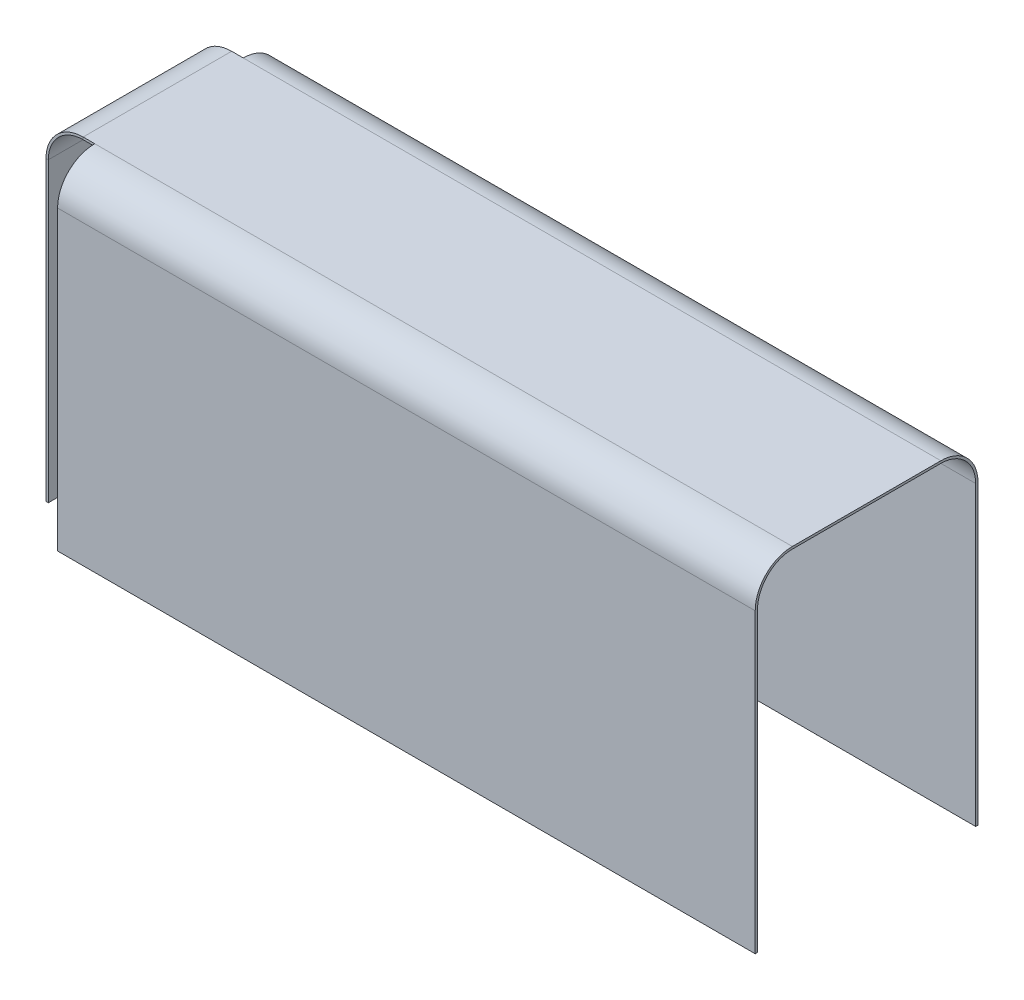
ISO-10303-21;
HEADER;
FILE_DESCRIPTION(('STEP AP214'),'2;1');
FILE_NAME('part.step','',(''),(''),'','','');
FILE_SCHEMA(('AUTOMOTIVE_DESIGN { 1 0 10303 214 1 1 1 1 }'));
ENDSEC;
DATA;
#1=APPLICATION_CONTEXT('core data for automotive mechanical design processes');
#2=APPLICATION_PROTOCOL_DEFINITION('international standard','automotive_design',2000,#1);
#3=PRODUCT_CONTEXT('',#1,'mechanical');
#4=PRODUCT('Part','Part','',(#3));
#5=PRODUCT_RELATED_PRODUCT_CATEGORY('part','',(#4));
#6=PRODUCT_DEFINITION_FORMATION('','',#4);
#7=PRODUCT_DEFINITION_CONTEXT('part definition',#1,'design');
#8=PRODUCT_DEFINITION('design','',#6,#7);
#9=PRODUCT_DEFINITION_SHAPE('','',#8);
#10=(LENGTH_UNIT() NAMED_UNIT(*) SI_UNIT(.MILLI.,.METRE.));
#11=(NAMED_UNIT(*) PLANE_ANGLE_UNIT() SI_UNIT($,.RADIAN.));
#12=(NAMED_UNIT(*) SI_UNIT($,.STERADIAN.) SOLID_ANGLE_UNIT());
#13=UNCERTAINTY_MEASURE_WITH_UNIT(LENGTH_MEASURE(1.E-05),#10,'distance_accuracy_value','');
#14=(GEOMETRIC_REPRESENTATION_CONTEXT(3) GLOBAL_UNCERTAINTY_ASSIGNED_CONTEXT((#13)) GLOBAL_UNIT_ASSIGNED_CONTEXT((#10,
#11,#12)) REPRESENTATION_CONTEXT('',''));
#15=CARTESIAN_POINT('',(0.,0.,0.));
#16=DIRECTION('',(0.,0.,1.));
#17=DIRECTION('',(1.,0.,0.));
#18=AXIS2_PLACEMENT_3D('',#15,#16,#17);
#19=CARTESIAN_POINT('',(-119.294275,114.3,38.1));
#20=DIRECTION('',(1.,0.,0.));
#21=DIRECTION('',(0.,0.,-1.));
#22=AXIS2_PLACEMENT_3D('',#19,#20,#21);
#23=PLANE('',#22);
#24=DIRECTION('',(0.,-1.,0.));
#25=VECTOR('',#24,1.);
#26=CARTESIAN_POINT('',(-119.294275,114.3,-25.4));
#27=LINE('',#26,#25);
#28=CARTESIAN_POINT('',(-119.294275,114.3,-25.4));
#29=VERTEX_POINT('',#28);
#30=CARTESIAN_POINT('',(-119.294275,113.50625,-25.4));
#31=VERTEX_POINT('',#30);
#32=EDGE_CURVE('E198',#29,#31,#27,.T.);
#33=ORIENTED_EDGE('',*,*,#32,.F.);
#34=CARTESIAN_POINT('',(-119.294275,101.6,-25.4));
#35=DIRECTION('',(1.,0.,0.));
#36=DIRECTION('',(0.,0.,-1.));
#37=AXIS2_PLACEMENT_3D('',#34,#35,#36);
#38=CIRCLE('',#37,12.7);
#39=CARTESIAN_POINT('',(-119.294275,101.6,-38.1));
#40=VERTEX_POINT('',#39);
#41=EDGE_CURVE('E315',#29,#40,#38,.F.);
#42=ORIENTED_EDGE('',*,*,#41,.T.);
#43=DIRECTION('',(0.,-1.,0.));
#44=VECTOR('',#43,1.);
#45=CARTESIAN_POINT('',(-119.294275,114.3,-38.1));
#46=LINE('',#45,#44);
#47=CARTESIAN_POINT('',(-119.294275,0.,-38.1));
#48=VERTEX_POINT('',#47);
#49=EDGE_CURVE('E285',#40,#48,#46,.T.);
#50=ORIENTED_EDGE('',*,*,#49,.T.);
#51=DIRECTION('',(0.,0.,1.));
#52=VECTOR('',#51,1.);
#53=CARTESIAN_POINT('',(-119.294275,0.,38.1));
#54=LINE('',#53,#52);
#55=CARTESIAN_POINT('',(-119.294275,0.,-37.30625));
#56=VERTEX_POINT('',#55);
#57=EDGE_CURVE('E287',#48,#56,#54,.T.);
#58=ORIENTED_EDGE('',*,*,#57,.T.);
#59=DIRECTION('',(0.,-1.,0.));
#60=VECTOR('',#59,1.);
#61=CARTESIAN_POINT('',(-119.294275,114.3,-37.30625));
#62=LINE('',#61,#60);
#63=CARTESIAN_POINT('',(-119.294275,101.6,-37.30625));
#64=VERTEX_POINT('',#63);
#65=EDGE_CURVE('E272',#64,#56,#62,.T.);
#66=ORIENTED_EDGE('',*,*,#65,.F.);
#67=CARTESIAN_POINT('',(-119.294275,101.6,-25.4));
#68=DIRECTION('',(1.,0.,0.));
#69=DIRECTION('',(0.,0.,-1.));
#70=AXIS2_PLACEMENT_3D('',#67,#68,#69);
#71=CIRCLE('',#70,11.90625);
#72=EDGE_CURVE('E262',#31,#64,#71,.F.);
#73=ORIENTED_EDGE('',*,*,#72,.F.);
#74=EDGE_LOOP('',(#33,#42,#50,#58,#66,#73));
#75=FACE_BOUND('',#74,.T.);
#76=ADVANCED_FACE('F33',(#75),#23,.F.);
#77=DIRECTION('',(0.,1.,0.));
#78=VECTOR('',#77,1.);
#79=CARTESIAN_POINT('',(-119.294275,114.3,25.4));
#80=LINE('',#79,#78);
#81=CARTESIAN_POINT('',(-119.294275,113.50625,25.4));
#82=VERTEX_POINT('',#81);
#83=CARTESIAN_POINT('',(-119.294275,114.3,25.4));
#84=VERTEX_POINT('',#83);
#85=EDGE_CURVE('E195',#82,#84,#80,.T.);
#86=ORIENTED_EDGE('',*,*,#85,.F.);
#87=CARTESIAN_POINT('',(-119.294275,101.6,25.4));
#88=DIRECTION('',(1.,0.,0.));
#89=DIRECTION('',(0.,0.,-1.));
#90=AXIS2_PLACEMENT_3D('',#87,#88,#89);
#91=CIRCLE('',#90,11.90625);
#92=CARTESIAN_POINT('',(-119.294275,101.6,37.30625));
#93=VERTEX_POINT('',#92);
#94=EDGE_CURVE('E258',#93,#82,#91,.F.);
#95=ORIENTED_EDGE('',*,*,#94,.F.);
#96=DIRECTION('',(0.,-1.,0.));
#97=VECTOR('',#96,1.);
#98=CARTESIAN_POINT('',(-119.294275,114.3,37.30625));
#99=LINE('',#98,#97);
#100=CARTESIAN_POINT('',(-119.294275,0.,37.30625));
#101=VERTEX_POINT('',#100);
#102=EDGE_CURVE('E256',#93,#101,#99,.T.);
#103=ORIENTED_EDGE('',*,*,#102,.T.);
#104=CARTESIAN_POINT('',(-119.294275,0.,38.1));
#105=VERTEX_POINT('',#104);
#106=EDGE_CURVE('E251',#101,#105,#54,.T.);
#107=ORIENTED_EDGE('',*,*,#106,.T.);
#108=DIRECTION('',(0.,-1.,0.));
#109=VECTOR('',#108,1.);
#110=CARTESIAN_POINT('',(-119.294275,114.3,38.1));
#111=LINE('',#110,#109);
#112=CARTESIAN_POINT('',(-119.294275,101.6,38.1));
#113=VERTEX_POINT('',#112);
#114=EDGE_CURVE('E305',#113,#105,#111,.T.);
#115=ORIENTED_EDGE('',*,*,#114,.F.);
#116=CARTESIAN_POINT('',(-119.294275,101.6,25.4));
#117=DIRECTION('',(1.,0.,0.));
#118=DIRECTION('',(0.,0.,-1.));
#119=AXIS2_PLACEMENT_3D('',#116,#117,#118);
#120=CIRCLE('',#119,12.7);
#121=EDGE_CURVE('E312',#113,#84,#120,.F.);
#122=ORIENTED_EDGE('',*,*,#121,.T.);
#123=EDGE_LOOP('',(#86,#95,#103,#107,#115,#122));
#124=FACE_BOUND('',#123,.T.);
#125=ADVANCED_FACE('F358',(#124),#23,.F.);
#126=CARTESIAN_POINT('',(0.,0.,0.));
#127=DIRECTION('',(0.,-1.,0.));
#128=DIRECTION('',(0.,0.,-1.));
#129=AXIS2_PLACEMENT_3D('',#126,#127,#128);
#130=PLANE('',#129);
#131=DIRECTION('',(0.,0.,-1.));
#132=VECTOR('',#131,1.);
#133=CARTESIAN_POINT('',(119.294275,0.,38.1));
#134=LINE('',#133,#132);
#135=CARTESIAN_POINT('',(119.294275,0.,-37.30625));
#136=VERTEX_POINT('',#135);
#137=CARTESIAN_POINT('',(119.294275,0.,-38.1));
#138=VERTEX_POINT('',#137);
#139=EDGE_CURVE('E293',#136,#138,#134,.T.);
#140=ORIENTED_EDGE('',*,*,#139,.F.);
#141=DIRECTION('',(-1.,0.,0.));
#142=VECTOR('',#141,1.);
#143=CARTESIAN_POINT('',(0.,0.,-37.30625));
#144=LINE('',#143,#142);
#145=EDGE_CURVE('E266',#136,#56,#144,.T.);
#146=ORIENTED_EDGE('',*,*,#145,.T.);
#147=ORIENTED_EDGE('',*,*,#57,.F.);
#148=DIRECTION('',(-1.,0.,0.));
#149=VECTOR('',#148,1.);
#150=CARTESIAN_POINT('',(-119.294275,0.,-38.1));
#151=LINE('',#150,#149);
#152=EDGE_CURVE('E286',#138,#48,#151,.T.);
#153=ORIENTED_EDGE('',*,*,#152,.F.);
#154=EDGE_LOOP('',(#140,#146,#147,#153));
#155=FACE_BOUND('',#154,.T.);
#156=ADVANCED_FACE('F336',(#155),#130,.T.);
#157=ORIENTED_EDGE('',*,*,#106,.F.);
#158=DIRECTION('',(1.,0.,0.));
#159=VECTOR('',#158,1.);
#160=CARTESIAN_POINT('',(0.,0.,37.30625));
#161=LINE('',#160,#159);
#162=CARTESIAN_POINT('',(119.294275,0.,37.30625));
#163=VERTEX_POINT('',#162);
#164=EDGE_CURVE('E248',#101,#163,#161,.T.);
#165=ORIENTED_EDGE('',*,*,#164,.T.);
#166=CARTESIAN_POINT('',(119.294275,0.,38.1));
#167=VERTEX_POINT('',#166);
#168=EDGE_CURVE('E294',#167,#163,#134,.T.);
#169=ORIENTED_EDGE('',*,*,#168,.F.);
#170=DIRECTION('',(1.,0.,0.));
#171=VECTOR('',#170,1.);
#172=CARTESIAN_POINT('',(-119.294275,0.,38.1));
#173=LINE('',#172,#171);
#174=EDGE_CURVE('E290',#105,#167,#173,.T.);
#175=ORIENTED_EDGE('',*,*,#174,.F.);
#176=EDGE_LOOP('',(#157,#165,#169,#175));
#177=FACE_BOUND('',#176,.T.);
#178=ADVANCED_FACE('F419',(#177),#130,.T.);
#179=CARTESIAN_POINT('',(-119.294275,114.3,38.1));
#180=DIRECTION('',(0.,0.,-1.));
#181=DIRECTION('',(-1.,0.,0.));
#182=AXIS2_PLACEMENT_3D('',#179,#180,#181);
#183=PLANE('',#182);
#184=DIRECTION('',(0.,-1.,0.));
#185=VECTOR('',#184,1.);
#186=CARTESIAN_POINT('',(119.294275,114.3,38.1));
#187=LINE('',#186,#185);
#188=CARTESIAN_POINT('',(119.294275,101.6,38.1));
#189=VERTEX_POINT('',#188);
#190=EDGE_CURVE('E303',#189,#167,#187,.T.);
#191=ORIENTED_EDGE('',*,*,#190,.F.);
#192=DIRECTION('',(1.,0.,0.));
#193=VECTOR('',#192,1.);
#194=CARTESIAN_POINT('',(-119.294275,101.6,38.1));
#195=LINE('',#194,#193);
#196=EDGE_CURVE('E11',#189,#113,#195,.F.);
#197=ORIENTED_EDGE('',*,*,#196,.T.);
#198=ORIENTED_EDGE('',*,*,#114,.T.);
#199=ORIENTED_EDGE('',*,*,#174,.T.);
#200=EDGE_LOOP('',(#191,#197,#198,#199));
#201=FACE_BOUND('',#200,.T.);
#202=ADVANCED_FACE('F403',(#201),#183,.F.);
#203=CARTESIAN_POINT('',(119.294275,114.3,38.1));
#204=DIRECTION('',(-1.,0.,0.));
#205=DIRECTION('',(0.,0.,1.));
#206=AXIS2_PLACEMENT_3D('',#203,#204,#205);
#207=PLANE('',#206);
#208=CARTESIAN_POINT('',(119.294275,101.6,-25.4));
#209=DIRECTION('',(-1.,0.,0.));
#210=DIRECTION('',(0.,0.,1.));
#211=AXIS2_PLACEMENT_3D('',#208,#209,#210);
#212=CIRCLE('',#211,11.90625);
#213=CARTESIAN_POINT('',(119.294275,101.6,-37.30625));
#214=VERTEX_POINT('',#213);
#215=CARTESIAN_POINT('',(119.294275,113.50625,-25.4));
#216=VERTEX_POINT('',#215);
#217=EDGE_CURVE('E252',#214,#216,#212,.F.);
#218=ORIENTED_EDGE('',*,*,#217,.F.);
#219=DIRECTION('',(0.,-1.,0.));
#220=VECTOR('',#219,1.);
#221=CARTESIAN_POINT('',(119.294275,114.3,-37.30625));
#222=LINE('',#221,#220);
#223=EDGE_CURVE('E264',#214,#136,#222,.T.);
#224=ORIENTED_EDGE('',*,*,#223,.T.);
#225=ORIENTED_EDGE('',*,*,#139,.T.);
#226=DIRECTION('',(0.,-1.,0.));
#227=VECTOR('',#226,1.);
#228=CARTESIAN_POINT('',(119.294275,114.3,-38.1));
#229=LINE('',#228,#227);
#230=CARTESIAN_POINT('',(119.294275,101.6,-38.1));
#231=VERTEX_POINT('',#230);
#232=EDGE_CURVE('E300',#231,#138,#229,.T.);
#233=ORIENTED_EDGE('',*,*,#232,.F.);
#234=CARTESIAN_POINT('',(119.294275,101.6,-25.4));
#235=DIRECTION('',(-1.,0.,0.));
#236=DIRECTION('',(0.,0.,1.));
#237=AXIS2_PLACEMENT_3D('',#234,#235,#236);
#238=CIRCLE('',#237,12.7);
#239=CARTESIAN_POINT('',(119.294275,114.3,-25.4));
#240=VERTEX_POINT('',#239);
#241=EDGE_CURVE('E41',#231,#240,#238,.F.);
#242=ORIENTED_EDGE('',*,*,#241,.T.);
#243=DIRECTION('',(0.,0.,-1.));
#244=VECTOR('',#243,1.);
#245=CARTESIAN_POINT('',(119.294275,114.3,38.1));
#246=LINE('',#245,#244);
#247=CARTESIAN_POINT('',(119.294275,114.3,25.4));
#248=VERTEX_POINT('',#247);
#249=EDGE_CURVE('E283',#248,#240,#246,.T.);
#250=ORIENTED_EDGE('',*,*,#249,.F.);
#251=CARTESIAN_POINT('',(119.294275,101.6,25.4));
#252=DIRECTION('',(-1.,0.,0.));
#253=DIRECTION('',(0.,0.,1.));
#254=AXIS2_PLACEMENT_3D('',#251,#252,#253);
#255=CIRCLE('',#254,12.7);
#256=EDGE_CURVE('E56',#248,#189,#255,.F.);
#257=ORIENTED_EDGE('',*,*,#256,.T.);
#258=ORIENTED_EDGE('',*,*,#190,.T.);
#259=ORIENTED_EDGE('',*,*,#168,.T.);
#260=DIRECTION('',(0.,-1.,0.));
#261=VECTOR('',#260,1.);
#262=CARTESIAN_POINT('',(119.294275,114.3,37.30625));
#263=LINE('',#262,#261);
#264=CARTESIAN_POINT('',(119.294275,101.6,37.30625));
#265=VERTEX_POINT('',#264);
#266=EDGE_CURVE('E48',#265,#163,#263,.T.);
#267=ORIENTED_EDGE('',*,*,#266,.F.);
#268=CARTESIAN_POINT('',(119.294275,101.6,25.4));
#269=DIRECTION('',(-1.,0.,0.));
#270=DIRECTION('',(0.,0.,1.));
#271=AXIS2_PLACEMENT_3D('',#268,#269,#270);
#272=CIRCLE('',#271,11.90625);
#273=CARTESIAN_POINT('',(119.294275,113.50625,25.4));
#274=VERTEX_POINT('',#273);
#275=EDGE_CURVE('E261',#274,#265,#272,.F.);
#276=ORIENTED_EDGE('',*,*,#275,.F.);
#277=DIRECTION('',(0.,0.,-1.));
#278=VECTOR('',#277,1.);
#279=CARTESIAN_POINT('',(119.294275,113.50625,0.));
#280=LINE('',#279,#278);
#281=EDGE_CURVE('E274',#274,#216,#280,.T.);
#282=ORIENTED_EDGE('',*,*,#281,.T.);
#283=EDGE_LOOP('',(#218,#224,#225,#233,#242,#250,#257,#258,#259,#267,#276,#282));
#284=FACE_BOUND('',#283,.T.);
#285=ADVANCED_FACE('F322',(#284),#207,.F.);
#286=CARTESIAN_POINT('',(-119.294275,114.3,-38.1));
#287=DIRECTION('',(0.,0.,1.));
#288=DIRECTION('',(1.,0.,0.));
#289=AXIS2_PLACEMENT_3D('',#286,#287,#288);
#290=PLANE('',#289);
#291=ORIENTED_EDGE('',*,*,#49,.F.);
#292=DIRECTION('',(-1.,0.,0.));
#293=VECTOR('',#292,1.);
#294=CARTESIAN_POINT('',(-119.294275,101.6,-38.1));
#295=LINE('',#294,#293);
#296=EDGE_CURVE('E317',#40,#231,#295,.F.);
#297=ORIENTED_EDGE('',*,*,#296,.T.);
#298=ORIENTED_EDGE('',*,*,#232,.T.);
#299=ORIENTED_EDGE('',*,*,#152,.T.);
#300=EDGE_LOOP('',(#291,#297,#298,#299));
#301=FACE_BOUND('',#300,.T.);
#302=ADVANCED_FACE('F331',(#301),#290,.F.);
#303=CARTESIAN_POINT('',(0.,114.3,0.));
#304=DIRECTION('',(0.,-1.,0.));
#305=DIRECTION('',(0.,0.,-1.));
#306=AXIS2_PLACEMENT_3D('',#303,#304,#305);
#307=PLANE('',#306);
#308=ORIENTED_EDGE('',*,*,#249,.T.);
#309=DIRECTION('',(-1.,0.,0.));
#310=VECTOR('',#309,1.);
#311=CARTESIAN_POINT('',(0.,114.3,-25.4));
#312=LINE('',#311,#310);
#313=EDGE_CURVE('E194',#240,#29,#312,.T.);
#314=ORIENTED_EDGE('',*,*,#313,.T.);
#315=DIRECTION('',(-1.,0.,0.));
#316=VECTOR('',#315,1.);
#317=CARTESIAN_POINT('',(-119.294275,114.3,-25.4));
#318=LINE('',#317,#316);
#319=CARTESIAN_POINT('',(-123.263025,114.3,-25.4));
#320=VERTEX_POINT('',#319);
#321=EDGE_CURVE('E186',#29,#320,#318,.T.);
#322=ORIENTED_EDGE('',*,*,#321,.T.);
#323=DIRECTION('',(0.,0.,-1.));
#324=VECTOR('',#323,1.);
#325=CARTESIAN_POINT('',(-123.263025,114.3,-25.4));
#326=LINE('',#325,#324);
#327=CARTESIAN_POINT('',(-123.263025,114.3,25.4));
#328=VERTEX_POINT('',#327);
#329=EDGE_CURVE('E169',#328,#320,#326,.T.);
#330=ORIENTED_EDGE('',*,*,#329,.F.);
#331=DIRECTION('',(-1.,0.,0.));
#332=VECTOR('',#331,1.);
#333=CARTESIAN_POINT('',(-119.294275,114.3,25.4));
#334=LINE('',#333,#332);
#335=EDGE_CURVE('E179',#84,#328,#334,.T.);
#336=ORIENTED_EDGE('',*,*,#335,.F.);
#337=DIRECTION('',(1.,0.,0.));
#338=VECTOR('',#337,1.);
#339=CARTESIAN_POINT('',(0.,114.3,25.4));
#340=LINE('',#339,#338);
#341=EDGE_CURVE('E308',#84,#248,#340,.T.);
#342=ORIENTED_EDGE('',*,*,#341,.T.);
#343=EDGE_LOOP('',(#308,#314,#322,#330,#336,#342));
#344=FACE_BOUND('',#343,.T.);
#345=ADVANCED_FACE('F192',(#344),#307,.F.);
#346=CARTESIAN_POINT('',(0.,101.6,-25.4));
#347=DIRECTION('',(-1.,0.,0.));
#348=DIRECTION('',(0.,0.,1.));
#349=AXIS2_PLACEMENT_3D('',#346,#347,#348);
#350=CYLINDRICAL_SURFACE('',#349,12.7);
#351=ORIENTED_EDGE('',*,*,#241,.F.);
#352=ORIENTED_EDGE('',*,*,#296,.F.);
#353=ORIENTED_EDGE('',*,*,#41,.F.);
#354=ORIENTED_EDGE('',*,*,#313,.F.);
#355=EDGE_LOOP('',(#351,#352,#353,#354));
#356=FACE_BOUND('',#355,.T.);
#357=ADVANCED_FACE('F326',(#356),#350,.T.);
#358=CARTESIAN_POINT('',(0.,101.6,25.4));
#359=DIRECTION('',(1.,0.,0.));
#360=DIRECTION('',(0.,0.,-1.));
#361=AXIS2_PLACEMENT_3D('',#358,#359,#360);
#362=CYLINDRICAL_SURFACE('',#361,12.7);
#363=ORIENTED_EDGE('',*,*,#121,.F.);
#364=ORIENTED_EDGE('',*,*,#196,.F.);
#365=ORIENTED_EDGE('',*,*,#256,.F.);
#366=ORIENTED_EDGE('',*,*,#341,.F.);
#367=EDGE_LOOP('',(#363,#364,#365,#366));
#368=FACE_BOUND('',#367,.T.);
#369=ADVANCED_FACE('F35',(#368),#362,.T.);
#370=CARTESIAN_POINT('',(-119.294275,114.3,37.30625));
#371=DIRECTION('',(0.,0.,-1.));
#372=DIRECTION('',(-1.,0.,0.));
#373=AXIS2_PLACEMENT_3D('',#370,#371,#372);
#374=PLANE('',#373);
#375=ORIENTED_EDGE('',*,*,#266,.T.);
#376=ORIENTED_EDGE('',*,*,#164,.F.);
#377=ORIENTED_EDGE('',*,*,#102,.F.);
#378=DIRECTION('',(-1.,0.,0.));
#379=VECTOR('',#378,1.);
#380=CARTESIAN_POINT('',(-119.294275,101.6,37.30625));
#381=LINE('',#380,#379);
#382=EDGE_CURVE('E249',#265,#93,#381,.T.);
#383=ORIENTED_EDGE('',*,*,#382,.F.);
#384=EDGE_LOOP('',(#375,#376,#377,#383));
#385=FACE_BOUND('',#384,.T.);
#386=ADVANCED_FACE('F354',(#385),#374,.T.);
#387=CARTESIAN_POINT('',(-119.294275,114.3,-37.30625));
#388=DIRECTION('',(0.,0.,1.));
#389=DIRECTION('',(1.,0.,0.));
#390=AXIS2_PLACEMENT_3D('',#387,#388,#389);
#391=PLANE('',#390);
#392=ORIENTED_EDGE('',*,*,#65,.T.);
#393=ORIENTED_EDGE('',*,*,#145,.F.);
#394=ORIENTED_EDGE('',*,*,#223,.F.);
#395=DIRECTION('',(1.,0.,0.));
#396=VECTOR('',#395,1.);
#397=CARTESIAN_POINT('',(-119.294275,101.6,-37.30625));
#398=LINE('',#397,#396);
#399=EDGE_CURVE('E259',#64,#214,#398,.T.);
#400=ORIENTED_EDGE('',*,*,#399,.F.);
#401=EDGE_LOOP('',(#392,#393,#394,#400));
#402=FACE_BOUND('',#401,.T.);
#403=ADVANCED_FACE('F340',(#402),#391,.T.);
#404=CARTESIAN_POINT('',(0.,113.50625,0.));
#405=DIRECTION('',(0.,-1.,0.));
#406=DIRECTION('',(0.,0.,-1.));
#407=AXIS2_PLACEMENT_3D('',#404,#405,#406);
#408=PLANE('',#407);
#409=ORIENTED_EDGE('',*,*,#281,.F.);
#410=DIRECTION('',(1.,0.,0.));
#411=VECTOR('',#410,1.);
#412=CARTESIAN_POINT('',(0.,113.50625,25.4));
#413=LINE('',#412,#411);
#414=EDGE_CURVE('E253',#82,#274,#413,.T.);
#415=ORIENTED_EDGE('',*,*,#414,.F.);
#416=DIRECTION('',(-1.,0.,0.));
#417=VECTOR('',#416,1.);
#418=CARTESIAN_POINT('',(-119.294275,113.50625,25.4));
#419=LINE('',#418,#417);
#420=CARTESIAN_POINT('',(-123.263025,113.50625,25.4));
#421=VERTEX_POINT('',#420);
#422=EDGE_CURVE('E219',#82,#421,#419,.T.);
#423=ORIENTED_EDGE('',*,*,#422,.T.);
#424=DIRECTION('',(0.,0.,1.));
#425=VECTOR('',#424,1.);
#426=CARTESIAN_POINT('',(-123.263025,113.50625,-25.4));
#427=LINE('',#426,#425);
#428=CARTESIAN_POINT('',(-123.263025,113.50625,-25.4));
#429=VERTEX_POINT('',#428);
#430=EDGE_CURVE('E216',#429,#421,#427,.T.);
#431=ORIENTED_EDGE('',*,*,#430,.F.);
#432=DIRECTION('',(-1.,0.,0.));
#433=VECTOR('',#432,1.);
#434=CARTESIAN_POINT('',(-119.294275,113.50625,-25.4));
#435=LINE('',#434,#433);
#436=EDGE_CURVE('E188',#31,#429,#435,.T.);
#437=ORIENTED_EDGE('',*,*,#436,.F.);
#438=DIRECTION('',(1.,0.,0.));
#439=VECTOR('',#438,1.);
#440=CARTESIAN_POINT('',(0.,113.50625,-25.4));
#441=LINE('',#440,#439);
#442=EDGE_CURVE('E255',#216,#31,#441,.F.);
#443=ORIENTED_EDGE('',*,*,#442,.F.);
#444=EDGE_LOOP('',(#409,#415,#423,#431,#437,#443));
#445=FACE_BOUND('',#444,.T.);
#446=ADVANCED_FACE('F347',(#445),#408,.T.);
#447=CARTESIAN_POINT('',(0.,101.6,-25.4));
#448=DIRECTION('',(-1.,0.,0.));
#449=DIRECTION('',(0.,0.,1.));
#450=AXIS2_PLACEMENT_3D('',#447,#448,#449);
#451=CYLINDRICAL_SURFACE('',#450,11.90625);
#452=ORIENTED_EDGE('',*,*,#217,.T.);
#453=ORIENTED_EDGE('',*,*,#442,.T.);
#454=ORIENTED_EDGE('',*,*,#72,.T.);
#455=ORIENTED_EDGE('',*,*,#399,.T.);
#456=EDGE_LOOP('',(#452,#453,#454,#455));
#457=FACE_BOUND('',#456,.T.);
#458=ADVANCED_FACE('F343',(#457),#451,.F.);
#459=CARTESIAN_POINT('',(0.,101.6,25.4));
#460=DIRECTION('',(1.,0.,0.));
#461=DIRECTION('',(0.,0.,-1.));
#462=AXIS2_PLACEMENT_3D('',#459,#460,#461);
#463=CYLINDRICAL_SURFACE('',#462,11.90625);
#464=ORIENTED_EDGE('',*,*,#94,.T.);
#465=ORIENTED_EDGE('',*,*,#414,.T.);
#466=ORIENTED_EDGE('',*,*,#275,.T.);
#467=ORIENTED_EDGE('',*,*,#382,.T.);
#468=EDGE_LOOP('',(#464,#465,#466,#467));
#469=FACE_BOUND('',#468,.T.);
#470=ADVANCED_FACE('F352',(#469),#463,.F.);
#471=CARTESIAN_POINT('',(-21.663025,0.,0.));
#472=DIRECTION('',(0.,-1.,0.));
#473=DIRECTION('',(0.,0.,1.));
#474=AXIS2_PLACEMENT_3D('',#471,#472,#473);
#475=PLANE('',#474);
#476=DIRECTION('',(1.,0.,0.));
#477=VECTOR('',#476,1.);
#478=CARTESIAN_POINT('',(-135.963025,0.,-25.4));
#479=LINE('',#478,#477);
#480=CARTESIAN_POINT('',(-135.963025,0.,-25.4));
#481=VERTEX_POINT('',#480);
#482=CARTESIAN_POINT('',(-135.169275,0.,-25.4));
#483=VERTEX_POINT('',#482);
#484=EDGE_CURVE('E206',#481,#483,#479,.T.);
#485=ORIENTED_EDGE('',*,*,#484,.T.);
#486=DIRECTION('',(0.,0.,1.));
#487=VECTOR('',#486,1.);
#488=CARTESIAN_POINT('',(-135.169275,0.,-25.4));
#489=LINE('',#488,#487);
#490=CARTESIAN_POINT('',(-135.169275,0.,25.4));
#491=VERTEX_POINT('',#490);
#492=EDGE_CURVE('E212',#483,#491,#489,.T.);
#493=ORIENTED_EDGE('',*,*,#492,.T.);
#494=DIRECTION('',(-1.,0.,0.));
#495=VECTOR('',#494,1.);
#496=CARTESIAN_POINT('',(-135.963025,0.,25.4));
#497=LINE('',#496,#495);
#498=CARTESIAN_POINT('',(-135.963025,0.,25.4));
#499=VERTEX_POINT('',#498);
#500=EDGE_CURVE('E232',#491,#499,#497,.T.);
#501=ORIENTED_EDGE('',*,*,#500,.T.);
#502=DIRECTION('',(0.,0.,-1.));
#503=VECTOR('',#502,1.);
#504=CARTESIAN_POINT('',(-135.963025,0.,-25.4));
#505=LINE('',#504,#503);
#506=EDGE_CURVE('E243',#499,#481,#505,.T.);
#507=ORIENTED_EDGE('',*,*,#506,.T.);
#508=EDGE_LOOP('',(#485,#493,#501,#507));
#509=FACE_BOUND('',#508,.T.);
#510=ADVANCED_FACE('F382',(#509),#475,.T.);
#511=CARTESIAN_POINT('',(-119.294275,114.3,-25.4));
#512=DIRECTION('',(0.,0.,-1.));
#513=DIRECTION('',(-1.,0.,0.));
#514=AXIS2_PLACEMENT_3D('',#511,#512,#513);
#515=PLANE('',#514);
#516=ORIENTED_EDGE('',*,*,#436,.T.);
#517=DIRECTION('',(0.,-1.,0.));
#518=VECTOR('',#517,1.);
#519=CARTESIAN_POINT('',(-123.263025,114.3,-25.4));
#520=LINE('',#519,#518);
#521=EDGE_CURVE('E164',#320,#429,#520,.T.);
#522=ORIENTED_EDGE('',*,*,#521,.F.);
#523=ORIENTED_EDGE('',*,*,#321,.F.);
#524=ORIENTED_EDGE('',*,*,#32,.T.);
#525=EDGE_LOOP('',(#516,#522,#523,#524));
#526=FACE_BOUND('',#525,.T.);
#527=ADVANCED_FACE('F184',(#526),#515,.T.);
#528=CARTESIAN_POINT('',(-119.294275,114.3,25.4));
#529=DIRECTION('',(0.,0.,1.));
#530=DIRECTION('',(0.,-1.,0.));
#531=AXIS2_PLACEMENT_3D('',#528,#529,#530);
#532=PLANE('',#531);
#533=ORIENTED_EDGE('',*,*,#335,.T.);
#534=DIRECTION('',(0.,1.,0.));
#535=VECTOR('',#534,1.);
#536=CARTESIAN_POINT('',(-123.263025,114.3,25.4));
#537=LINE('',#536,#535);
#538=EDGE_CURVE('E222',#421,#328,#537,.T.);
#539=ORIENTED_EDGE('',*,*,#538,.F.);
#540=ORIENTED_EDGE('',*,*,#422,.F.);
#541=ORIENTED_EDGE('',*,*,#85,.T.);
#542=EDGE_LOOP('',(#533,#539,#540,#541));
#543=FACE_BOUND('',#542,.T.);
#544=ADVANCED_FACE('F362',(#543),#532,.T.);
#545=CARTESIAN_POINT('',(-123.263025,114.3,-25.4));
#546=DIRECTION('',(0.,0.,-1.));
#547=DIRECTION('',(-1.,0.,0.));
#548=AXIS2_PLACEMENT_3D('',#545,#546,#547);
#549=PLANE('',#548);
#550=CARTESIAN_POINT('',(-123.263025,101.6,-25.4));
#551=DIRECTION('',(0.,0.,1.));
#552=DIRECTION('',(0.,1.,0.));
#553=AXIS2_PLACEMENT_3D('',#550,#551,#552);
#554=CIRCLE('',#553,11.90625);
#555=CARTESIAN_POINT('',(-135.169275,101.6,-25.4));
#556=VERTEX_POINT('',#555);
#557=EDGE_CURVE('E203',#429,#556,#554,.T.);
#558=ORIENTED_EDGE('',*,*,#557,.T.);
#559=DIRECTION('',(1.,0.,0.));
#560=VECTOR('',#559,1.);
#561=CARTESIAN_POINT('',(-135.963025,101.6,-25.4));
#562=LINE('',#561,#560);
#563=CARTESIAN_POINT('',(-135.963025,101.6,-25.4));
#564=VERTEX_POINT('',#563);
#565=EDGE_CURVE('E166',#564,#556,#562,.T.);
#566=ORIENTED_EDGE('',*,*,#565,.F.);
#567=CARTESIAN_POINT('',(-123.263025,101.6,-25.4));
#568=DIRECTION('',(0.,0.,1.));
#569=DIRECTION('',(0.,1.,0.));
#570=AXIS2_PLACEMENT_3D('',#567,#568,#569);
#571=CIRCLE('',#570,12.7);
#572=EDGE_CURVE('E159',#320,#564,#571,.T.);
#573=ORIENTED_EDGE('',*,*,#572,.F.);
#574=ORIENTED_EDGE('',*,*,#521,.T.);
#575=EDGE_LOOP('',(#558,#566,#573,#574));
#576=FACE_BOUND('',#575,.T.);
#577=ADVANCED_FACE('F162',(#576),#549,.T.);
#578=CARTESIAN_POINT('',(-123.263025,101.6,0.));
#579=DIRECTION('',(0.,0.,1.));
#580=DIRECTION('',(1.,0.,0.));
#581=AXIS2_PLACEMENT_3D('',#578,#579,#580);
#582=CYLINDRICAL_SURFACE('',#581,11.90625);
#583=CARTESIAN_POINT('',(-123.263025,101.6,25.4));
#584=DIRECTION('',(0.,0.,1.));
#585=DIRECTION('',(0.,1.,0.));
#586=AXIS2_PLACEMENT_3D('',#583,#584,#585);
#587=CIRCLE('',#586,11.90625);
#588=CARTESIAN_POINT('',(-135.169275,101.6,25.4));
#589=VERTEX_POINT('',#588);
#590=EDGE_CURVE('E225',#421,#589,#587,.T.);
#591=ORIENTED_EDGE('',*,*,#590,.T.);
#592=DIRECTION('',(0.,0.,1.));
#593=VECTOR('',#592,1.);
#594=CARTESIAN_POINT('',(-135.169275,101.6,-25.4));
#595=LINE('',#594,#593);
#596=EDGE_CURVE('E204',#556,#589,#595,.T.);
#597=ORIENTED_EDGE('',*,*,#596,.F.);
#598=ORIENTED_EDGE('',*,*,#557,.F.);
#599=ORIENTED_EDGE('',*,*,#430,.T.);
#600=EDGE_LOOP('',(#591,#597,#598,#599));
#601=FACE_BOUND('',#600,.T.);
#602=ADVANCED_FACE('F368',(#601),#582,.F.);
#603=CARTESIAN_POINT('',(-123.263025,114.3,25.4));
#604=DIRECTION('',(0.,0.,1.));
#605=DIRECTION('',(1.,0.,0.));
#606=AXIS2_PLACEMENT_3D('',#603,#604,#605);
#607=PLANE('',#606);
#608=CARTESIAN_POINT('',(-123.263025,101.6,25.4));
#609=DIRECTION('',(0.,0.,1.));
#610=DIRECTION('',(0.,1.,0.));
#611=AXIS2_PLACEMENT_3D('',#608,#609,#610);
#612=CIRCLE('',#611,12.7);
#613=CARTESIAN_POINT('',(-135.963025,101.6,25.4));
#614=VERTEX_POINT('',#613);
#615=EDGE_CURVE('E174',#328,#614,#612,.T.);
#616=ORIENTED_EDGE('',*,*,#615,.T.);
#617=DIRECTION('',(-1.,0.,0.));
#618=VECTOR('',#617,1.);
#619=CARTESIAN_POINT('',(-135.963025,101.6,25.4));
#620=LINE('',#619,#618);
#621=EDGE_CURVE('E228',#589,#614,#620,.T.);
#622=ORIENTED_EDGE('',*,*,#621,.F.);
#623=ORIENTED_EDGE('',*,*,#590,.F.);
#624=ORIENTED_EDGE('',*,*,#538,.T.);
#625=EDGE_LOOP('',(#616,#622,#623,#624));
#626=FACE_BOUND('',#625,.T.);
#627=ADVANCED_FACE('F364',(#626),#607,.T.);
#628=CARTESIAN_POINT('',(-123.263025,101.6,0.));
#629=DIRECTION('',(0.,0.,1.));
#630=DIRECTION('',(1.,0.,0.));
#631=AXIS2_PLACEMENT_3D('',#628,#629,#630);
#632=CYLINDRICAL_SURFACE('',#631,12.7);
#633=DIRECTION('',(0.,0.,-1.));
#634=VECTOR('',#633,1.);
#635=CARTESIAN_POINT('',(-135.963025,101.6,-25.4));
#636=LINE('',#635,#634);
#637=EDGE_CURVE('E215',#614,#564,#636,.T.);
#638=ORIENTED_EDGE('',*,*,#637,.F.);
#639=ORIENTED_EDGE('',*,*,#615,.F.);
#640=ORIENTED_EDGE('',*,*,#329,.T.);
#641=ORIENTED_EDGE('',*,*,#572,.T.);
#642=EDGE_LOOP('',(#638,#639,#640,#641));
#643=FACE_BOUND('',#642,.T.);
#644=ADVANCED_FACE('F172',(#643),#632,.T.);
#645=CARTESIAN_POINT('',(-135.963025,101.6,-25.4));
#646=DIRECTION('',(0.,0.,-1.));
#647=DIRECTION('',(-1.,0.,0.));
#648=AXIS2_PLACEMENT_3D('',#645,#646,#647);
#649=PLANE('',#648);
#650=DIRECTION('',(0.,-1.,0.));
#651=VECTOR('',#650,1.);
#652=CARTESIAN_POINT('',(-135.169275,101.6,-25.4));
#653=LINE('',#652,#651);
#654=EDGE_CURVE('E208',#556,#483,#653,.T.);
#655=ORIENTED_EDGE('',*,*,#654,.T.);
#656=ORIENTED_EDGE('',*,*,#484,.F.);
#657=DIRECTION('',(0.,-1.,0.));
#658=VECTOR('',#657,1.);
#659=CARTESIAN_POINT('',(-135.963025,101.6,-25.4));
#660=LINE('',#659,#658);
#661=EDGE_CURVE('E209',#564,#481,#660,.T.);
#662=ORIENTED_EDGE('',*,*,#661,.F.);
#663=ORIENTED_EDGE('',*,*,#565,.T.);
#664=EDGE_LOOP('',(#655,#656,#662,#663));
#665=FACE_BOUND('',#664,.T.);
#666=ADVANCED_FACE('F374',(#665),#649,.T.);
#667=CARTESIAN_POINT('',(-135.169275,101.6,-25.4));
#668=DIRECTION('',(1.,0.,0.));
#669=DIRECTION('',(0.,0.,-1.));
#670=AXIS2_PLACEMENT_3D('',#667,#668,#669);
#671=PLANE('',#670);
#672=CARTESIAN_POINT('',(-135.169275,22.5425,0.));
#673=DIRECTION('',(1.,0.,0.));
#674=DIRECTION('',(0.,0.,-1.));
#675=AXIS2_PLACEMENT_3D('',#672,#673,#674);
#676=CIRCLE('',#675,2.54);
#677=CARTESIAN_POINT('',(-135.169275,22.5425,-2.54));
#678=VERTEX_POINT('',#677);
#679=EDGE_CURVE('E578',#678,#678,#676,.T.);
#680=ORIENTED_EDGE('',*,*,#679,.F.);
#681=EDGE_LOOP('',(#680));
#682=FACE_BOUND('',#681,.T.);
#683=DIRECTION('',(0.,-1.,0.));
#684=VECTOR('',#683,1.);
#685=CARTESIAN_POINT('',(-135.169275,101.6,25.4));
#686=LINE('',#685,#684);
#687=EDGE_CURVE('E230',#589,#491,#686,.T.);
#688=ORIENTED_EDGE('',*,*,#687,.T.);
#689=ORIENTED_EDGE('',*,*,#492,.F.);
#690=ORIENTED_EDGE('',*,*,#654,.F.);
#691=ORIENTED_EDGE('',*,*,#596,.T.);
#692=EDGE_LOOP('',(#688,#689,#690,#691));
#693=FACE_BOUND('',#692,.T.);
#694=ADVANCED_FACE('F370',(#682,#693),#671,.T.);
#695=CARTESIAN_POINT('',(-135.963025,101.6,25.4));
#696=DIRECTION('',(0.,0.,1.));
#697=DIRECTION('',(1.,0.,0.));
#698=AXIS2_PLACEMENT_3D('',#695,#696,#697);
#699=PLANE('',#698);
#700=DIRECTION('',(0.,-1.,0.));
#701=VECTOR('',#700,1.);
#702=CARTESIAN_POINT('',(-135.963025,101.6,25.4));
#703=LINE('',#702,#701);
#704=EDGE_CURVE('E241',#614,#499,#703,.T.);
#705=ORIENTED_EDGE('',*,*,#704,.T.);
#706=ORIENTED_EDGE('',*,*,#500,.F.);
#707=ORIENTED_EDGE('',*,*,#687,.F.);
#708=ORIENTED_EDGE('',*,*,#621,.T.);
#709=EDGE_LOOP('',(#705,#706,#707,#708));
#710=FACE_BOUND('',#709,.T.);
#711=ADVANCED_FACE('F380',(#710),#699,.T.);
#712=CARTESIAN_POINT('',(-135.963025,101.6,-25.4));
#713=DIRECTION('',(-1.,0.,0.));
#714=DIRECTION('',(0.,0.,1.));
#715=AXIS2_PLACEMENT_3D('',#712,#713,#714);
#716=PLANE('',#715);
#717=CARTESIAN_POINT('',(-135.963025,22.5425,0.));
#718=DIRECTION('',(-1.,0.,0.));
#719=DIRECTION('',(0.,0.,1.));
#720=AXIS2_PLACEMENT_3D('',#717,#718,#719);
#721=CIRCLE('',#720,2.54);
#722=CARTESIAN_POINT('',(-135.963025,22.5425,2.54));
#723=VERTEX_POINT('',#722);
#724=EDGE_CURVE('E576',#723,#723,#721,.T.);
#725=ORIENTED_EDGE('',*,*,#724,.F.);
#726=EDGE_LOOP('',(#725));
#727=FACE_BOUND('',#726,.T.);
#728=ORIENTED_EDGE('',*,*,#506,.F.);
#729=ORIENTED_EDGE('',*,*,#704,.F.);
#730=ORIENTED_EDGE('',*,*,#637,.T.);
#731=ORIENTED_EDGE('',*,*,#661,.T.);
#732=EDGE_LOOP('',(#728,#729,#730,#731));
#733=FACE_BOUND('',#732,.T.);
#734=ADVANCED_FACE('F377',(#727,#733),#716,.T.);
#735=CARTESIAN_POINT('',(-133.423025,22.5425,0.));
#736=DIRECTION('',(-1.,0.,0.));
#737=DIRECTION('',(0.,0.,1.));
#738=AXIS2_PLACEMENT_3D('',#735,#736,#737);
#739=CYLINDRICAL_SURFACE('',#738,2.54);
#740=ORIENTED_EDGE('',*,*,#679,.T.);
#741=EDGE_LOOP('',(#740));
#742=FACE_BOUND('',#741,.T.);
#743=ORIENTED_EDGE('',*,*,#724,.T.);
#744=EDGE_LOOP('',(#743));
#745=FACE_BOUND('',#744,.T.);
#746=ADVANCED_FACE('F385',(#742,#745),#739,.F.);
#747=CLOSED_SHELL('',(#76,#125,#156,#178,#202,#285,#302,#345,#357,#369,#386,#403,#446,#458,#470,
#510,#527,#544,#577,#602,#627,#644,#666,#694,#711,#734,#746));
#748=MANIFOLD_SOLID_BREP('B2',#747);
#749=ADVANCED_BREP_SHAPE_REPRESENTATION('',(#18,#748),#14);
#750=SHAPE_DEFINITION_REPRESENTATION(#9,#749);
ENDSEC;
END-ISO-10303-21;
